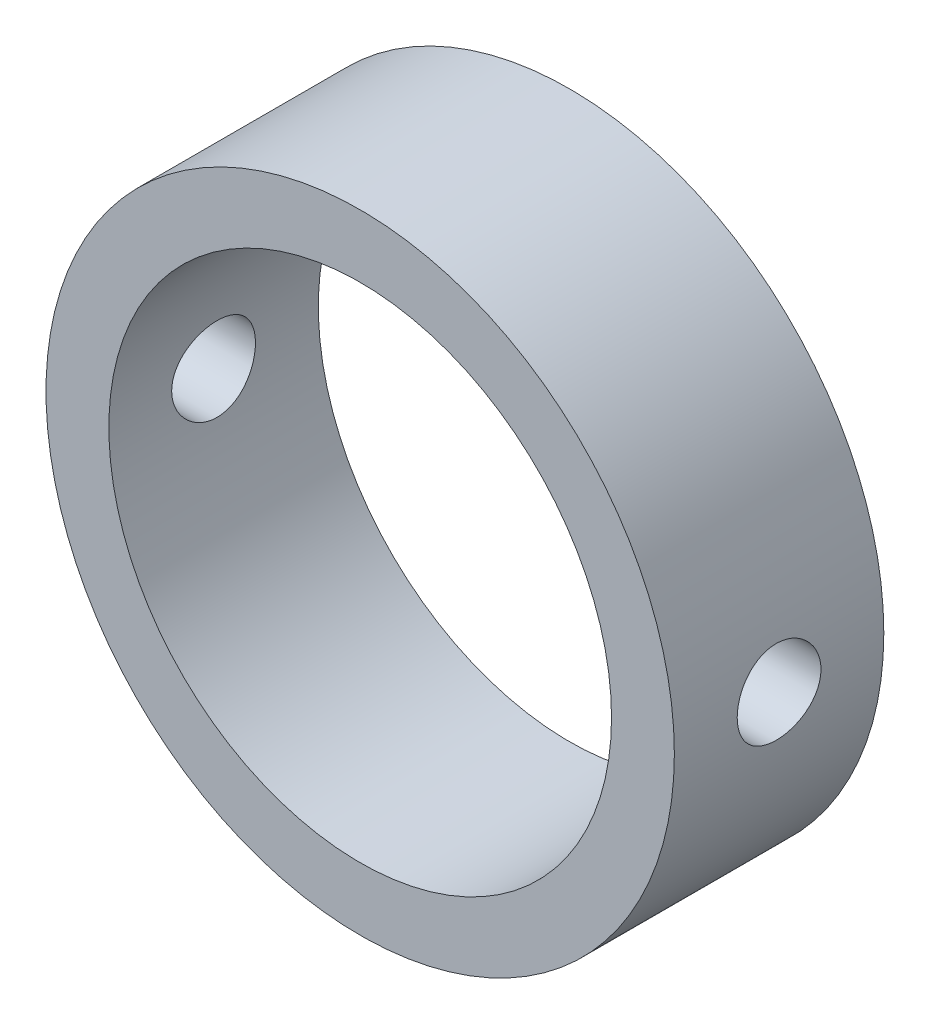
from build123d import *

# Parameters (mm, degrees)
ESQUISSE1_R             = 30
ESQUISSE1_R_2           = 24
EXTRUSION1_DEPTH        = 20
ESQUISSE2_R             = 4
ENL_V_MAT_EXTRU_1_DEPTH = 40


with BuildPart() as part:
    # Esquisse1 → Extrusion1 (new body)
    with BuildSketch(Plane.XY):
        Circle(ESQUISSE1_R)
        Circle(ESQUISSE1_R_2, mode=Mode.SUBTRACT)
    extrude(amount=EXTRUSION1_DEPTH)

    # Esquisse2 → Enl_v. mat.-Extru.1 (cut, symmetric)
    with BuildSketch(Plane(origin=(0, 0, 0), x_dir=(0, 0, -1), z_dir=(1, 0, 0))):
        with Locations((-10, 0)):
            Circle(ESQUISSE2_R)
    extrude(amount=ENL_V_MAT_EXTRU_1_DEPTH, both=True, mode=Mode.SUBTRACT)


solid = part.part
